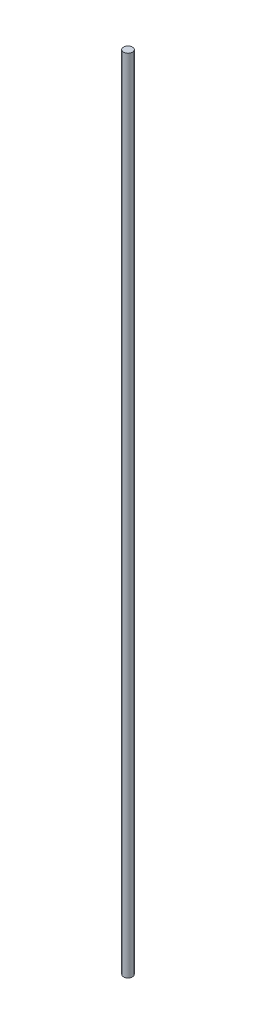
from build123d import *

# Parameters (mm, degrees)
SKETCH1_R           = 6.35
BOSS_EXTRUDE1_DEPTH = 571.5


with BuildPart() as part:
    # Sketch1 → Boss-Extrude1 (new, symmetric)
    with BuildSketch(Plane(origin=(0, 0, 0), x_dir=(1, 0, 0), z_dir=(0, 1, 0))):
        with Locations(Location((0, 0, 0), (0, 0, 270))):
            Circle(SKETCH1_R)
    extrude(amount=BOSS_EXTRUDE1_DEPTH, both=True)


solid = part.part
